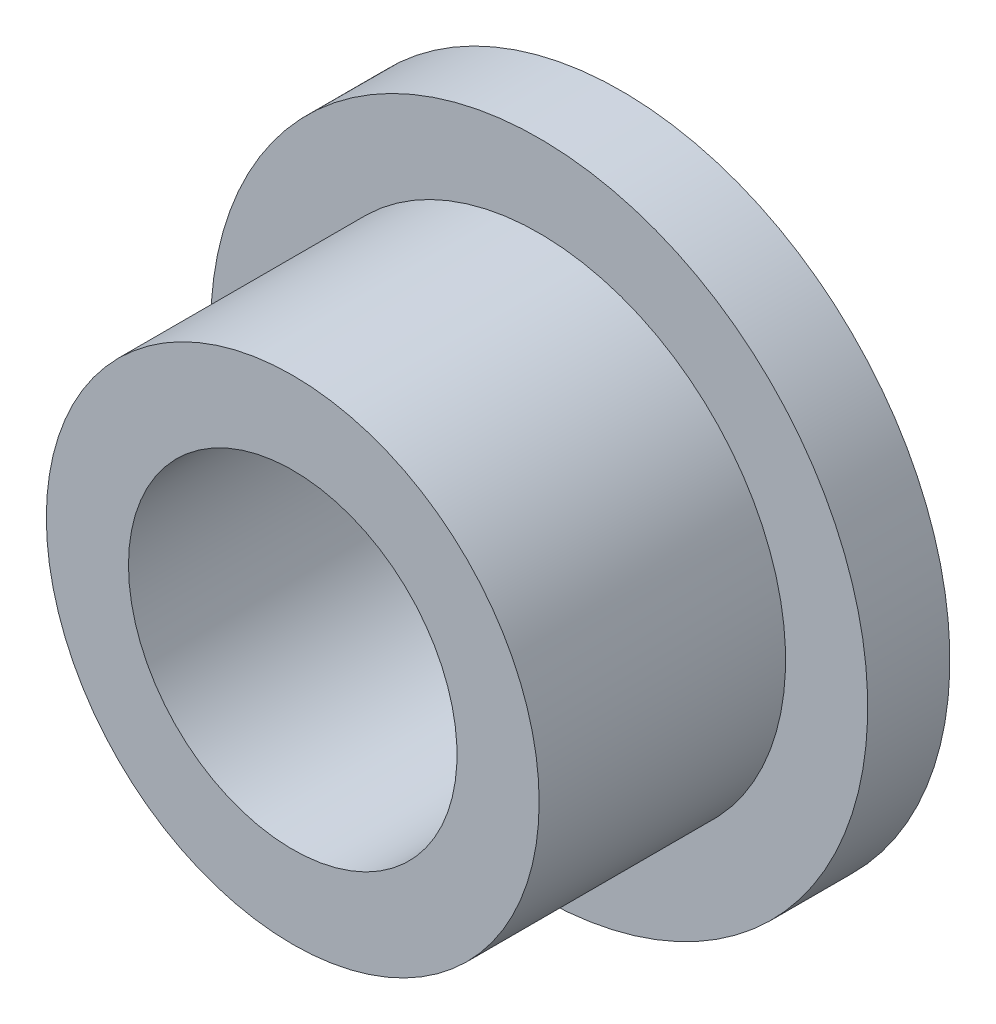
from build123d import *

# Parameters (mm, degrees)
SKETCH1_R          = 15
EXTRUDE1_DEPTH     = 15
SKETCH2_R          = 20
EXTRUDE2_DEPTH     = 5
SKETCH3_R          = 10
CUT_EXTRUDE1_DEPTH = 35.641016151


with BuildPart() as part:
    # Sketch1 → Extrude1 (new body)
    with BuildSketch(Plane.XY):
        Circle(SKETCH1_R)
    extrude(amount=EXTRUDE1_DEPTH)

    # Sketch2 → Extrude2 (add)
    with BuildSketch(Plane(origin=(0, 0, 0), x_dir=(-1, 0, 0), z_dir=(0, 0, -1))):
        Circle(SKETCH2_R)
    extrude(amount=EXTRUDE2_DEPTH)

    # Sketch3 → Cut-Extrude1 (cut, through all)
    with BuildSketch(Plane(origin=(0, 0, -5), x_dir=(-1, 0, 0), z_dir=(0, 0, -1))):
        Circle(SKETCH3_R)
    extrude(amount=-CUT_EXTRUDE1_DEPTH, mode=Mode.SUBTRACT)


solid = part.part
